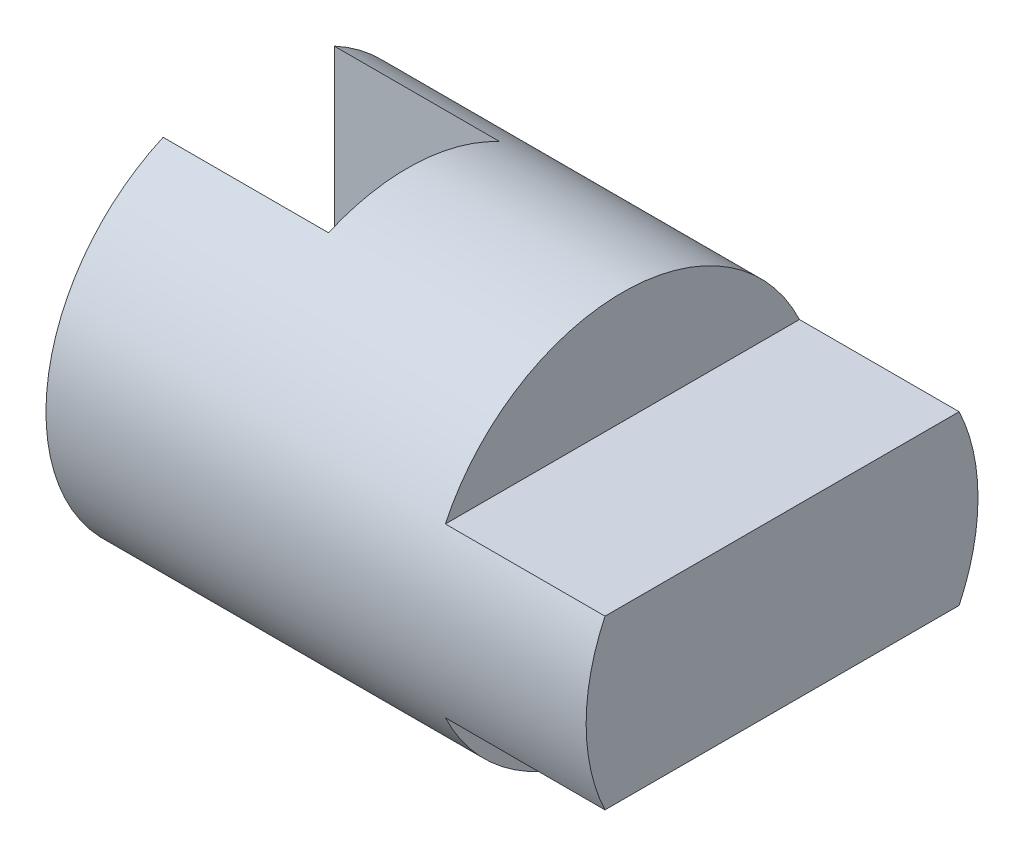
ISO-10303-21;
HEADER;
FILE_DESCRIPTION(('STEP AP214'),'2;1');
FILE_NAME('part.step','',(''),(''),'','','');
FILE_SCHEMA(('AUTOMOTIVE_DESIGN { 1 0 10303 214 1 1 1 1 }'));
ENDSEC;
DATA;
#1=APPLICATION_CONTEXT('core data for automotive mechanical design processes');
#2=APPLICATION_PROTOCOL_DEFINITION('international standard','automotive_design',2000,#1);
#3=PRODUCT_CONTEXT('',#1,'mechanical');
#4=PRODUCT('Part','Part','',(#3));
#5=PRODUCT_RELATED_PRODUCT_CATEGORY('part','',(#4));
#6=PRODUCT_DEFINITION_FORMATION('','',#4);
#7=PRODUCT_DEFINITION_CONTEXT('part definition',#1,'design');
#8=PRODUCT_DEFINITION('design','',#6,#7);
#9=PRODUCT_DEFINITION_SHAPE('','',#8);
#10=(LENGTH_UNIT() NAMED_UNIT(*) SI_UNIT(.MILLI.,.METRE.));
#11=(NAMED_UNIT(*) PLANE_ANGLE_UNIT() SI_UNIT($,.RADIAN.));
#12=(NAMED_UNIT(*) SI_UNIT($,.STERADIAN.) SOLID_ANGLE_UNIT());
#13=UNCERTAINTY_MEASURE_WITH_UNIT(LENGTH_MEASURE(1.E-05),#10,'distance_accuracy_value','');
#14=(GEOMETRIC_REPRESENTATION_CONTEXT(3) GLOBAL_UNCERTAINTY_ASSIGNED_CONTEXT((#13)) GLOBAL_UNIT_ASSIGNED_CONTEXT((#10,
#11,#12)) REPRESENTATION_CONTEXT('',''));
#15=CARTESIAN_POINT('',(0.,0.,0.));
#16=DIRECTION('',(0.,0.,1.));
#17=DIRECTION('',(1.,0.,0.));
#18=AXIS2_PLACEMENT_3D('',#15,#16,#17);
#19=CARTESIAN_POINT('',(-55.4943825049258,0.,0.));
#20=DIRECTION('',(1.,0.,0.));
#21=DIRECTION('',(0.,0.,-1.));
#22=AXIS2_PLACEMENT_3D('',#19,#20,#21);
#23=PLANE('',#22);
#24=CARTESIAN_POINT('',(-55.4943825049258,0.,0.));
#25=DIRECTION('',(-1.,0.,0.));
#26=DIRECTION('',(0.,0.,1.));
#27=AXIS2_PLACEMENT_3D('',#24,#25,#26);
#28=CIRCLE('',#27,37.2702200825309);
#29=CARTESIAN_POINT('',(-55.4943825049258,32.8639869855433,-17.5791827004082));
#30=VERTEX_POINT('',#29);
#31=CARTESIAN_POINT('',(-55.4943825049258,-32.8639869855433,-17.5791827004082));
#32=VERTEX_POINT('',#31);
#33=EDGE_CURVE('E151',#30,#32,#28,.T.);
#34=ORIENTED_EDGE('',*,*,#33,.T.);
#35=DIRECTION('',(0.,1.,0.));
#36=VECTOR('',#35,1.);
#37=CARTESIAN_POINT('',(-55.4943825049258,-37.2702200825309,-17.5791827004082));
#38=LINE('',#37,#36);
#39=EDGE_CURVE('E133',#32,#30,#38,.T.);
#40=ORIENTED_EDGE('',*,*,#39,.T.);
#41=EDGE_LOOP('',(#34,#40));
#42=FACE_BOUND('',#41,.T.);
#43=ADVANCED_FACE('F31',(#42),#23,.F.);
#44=CARTESIAN_POINT('',(-55.4943825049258,-34.125283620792,14.9844693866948));
#45=VERTEX_POINT('',#44);
#46=CARTESIAN_POINT('',(-55.4943825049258,34.125283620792,14.9844693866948));
#47=VERTEX_POINT('',#46);
#48=EDGE_CURVE('E124',#45,#47,#28,.T.);
#49=ORIENTED_EDGE('',*,*,#48,.T.);
#50=DIRECTION('',(0.,1.,0.));
#51=VECTOR('',#50,1.);
#52=CARTESIAN_POINT('',(-55.4943825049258,-37.2702200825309,14.9844693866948));
#53=LINE('',#52,#51);
#54=EDGE_CURVE('E103',#45,#47,#53,.T.);
#55=ORIENTED_EDGE('',*,*,#54,.F.);
#56=EDGE_LOOP('',(#49,#55));
#57=FACE_BOUND('',#56,.T.);
#58=ADVANCED_FACE('F33',(#57),#23,.F.);
#59=CARTESIAN_POINT('',(-80.4401871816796,0.,0.));
#60=DIRECTION('',(-1.,0.,0.));
#61=DIRECTION('',(0.,0.,1.));
#62=AXIS2_PLACEMENT_3D('',#59,#60,#61);
#63=CYLINDRICAL_SURFACE('',#62,37.2702200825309);
#64=CARTESIAN_POINT('',(16.8863951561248,0.,0.));
#65=DIRECTION('',(-1.,0.,0.));
#66=DIRECTION('',(0.,-1.,0.));
#67=AXIS2_PLACEMENT_3D('',#64,#65,#66);
#68=CIRCLE('',#67,37.2702200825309);
#69=CARTESIAN_POINT('',(16.8863951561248,-15.9589152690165,-33.6805927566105));
#70=VERTEX_POINT('',#69);
#71=CARTESIAN_POINT('',(16.8863951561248,-15.9589152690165,33.6805927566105));
#72=VERTEX_POINT('',#71);
#73=EDGE_CURVE('E116',#70,#72,#68,.T.);
#74=ORIENTED_EDGE('',*,*,#73,.T.);
#75=DIRECTION('',(-1.,0.,0.));
#76=VECTOR('',#75,1.);
#77=CARTESIAN_POINT('',(-80.4401871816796,-15.9589152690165,33.6805927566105));
#78=LINE('',#77,#76);
#79=CARTESIAN_POINT('',(47.2585748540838,-15.9589152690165,33.6805927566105));
#80=VERTEX_POINT('',#79);
#81=EDGE_CURVE('E132',#72,#80,#78,.F.);
#82=ORIENTED_EDGE('',*,*,#81,.T.);
#83=CARTESIAN_POINT('',(47.2585748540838,0.,0.));
#84=DIRECTION('',(-1.,0.,0.));
#85=DIRECTION('',(0.,0.,1.));
#86=AXIS2_PLACEMENT_3D('',#83,#84,#85);
#87=CIRCLE('',#86,37.2702200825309);
#88=CARTESIAN_POINT('',(47.2585748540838,15.9589152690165,33.6805927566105));
#89=VERTEX_POINT('',#88);
#90=EDGE_CURVE('E146',#80,#89,#87,.T.);
#91=ORIENTED_EDGE('',*,*,#90,.T.);
#92=DIRECTION('',(-1.,0.,0.));
#93=VECTOR('',#92,1.);
#94=CARTESIAN_POINT('',(-80.4401871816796,15.9589152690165,33.6805927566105));
#95=LINE('',#94,#93);
#96=CARTESIAN_POINT('',(16.8863951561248,15.9589152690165,33.6805927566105));
#97=VERTEX_POINT('',#96);
#98=EDGE_CURVE('E143',#89,#97,#95,.T.);
#99=ORIENTED_EDGE('',*,*,#98,.T.);
#100=CARTESIAN_POINT('',(16.8863951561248,0.,0.));
#101=DIRECTION('',(-1.,0.,0.));
#102=DIRECTION('',(0.,0.,1.));
#103=AXIS2_PLACEMENT_3D('',#100,#101,#102);
#104=CIRCLE('',#103,37.2702200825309);
#105=CARTESIAN_POINT('',(16.8863951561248,15.9589152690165,-33.6805927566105));
#106=VERTEX_POINT('',#105);
#107=EDGE_CURVE('E155',#97,#106,#104,.T.);
#108=ORIENTED_EDGE('',*,*,#107,.T.);
#109=DIRECTION('',(-1.,0.,0.));
#110=VECTOR('',#109,1.);
#111=CARTESIAN_POINT('',(-80.4401871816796,15.9589152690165,-33.6805927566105));
#112=LINE('',#111,#110);
#113=CARTESIAN_POINT('',(47.2585748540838,15.9589152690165,-33.6805927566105));
#114=VERTEX_POINT('',#113);
#115=EDGE_CURVE('E140',#106,#114,#112,.F.);
#116=ORIENTED_EDGE('',*,*,#115,.T.);
#117=CARTESIAN_POINT('',(47.2585748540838,-15.9589152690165,-33.6805927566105));
#118=VERTEX_POINT('',#117);
#119=EDGE_CURVE('E147',#114,#118,#87,.T.);
#120=ORIENTED_EDGE('',*,*,#119,.T.);
#121=DIRECTION('',(-1.,0.,0.));
#122=VECTOR('',#121,1.);
#123=CARTESIAN_POINT('',(-80.4401871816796,-15.9589152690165,-33.6805927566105));
#124=LINE('',#123,#122);
#125=EDGE_CURVE('E54',#118,#70,#124,.T.);
#126=ORIENTED_EDGE('',*,*,#125,.T.);
#127=EDGE_LOOP('',(#74,#82,#91,#99,#108,#116,#120,#126));
#128=FACE_BOUND('',#127,.T.);
#129=ORIENTED_EDGE('',*,*,#33,.F.);
#130=DIRECTION('',(-1.,0.,0.));
#131=VECTOR('',#130,1.);
#132=CARTESIAN_POINT('',(-80.4401871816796,32.8639869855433,-17.5791827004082));
#133=LINE('',#132,#131);
#134=CARTESIAN_POINT('',(-24.0323285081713,32.8639869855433,-17.5791827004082));
#135=VERTEX_POINT('',#134);
#136=EDGE_CURVE('E11',#30,#135,#133,.F.);
#137=ORIENTED_EDGE('',*,*,#136,.T.);
#138=CARTESIAN_POINT('',(-24.0323285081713,0.,0.));
#139=DIRECTION('',(1.,0.,0.));
#140=DIRECTION('',(0.,0.,-1.));
#141=AXIS2_PLACEMENT_3D('',#138,#139,#140);
#142=CIRCLE('',#141,37.2702200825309);
#143=CARTESIAN_POINT('',(-24.0323285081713,34.125283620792,14.9844693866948));
#144=VERTEX_POINT('',#143);
#145=EDGE_CURVE('E108',#135,#144,#142,.T.);
#146=ORIENTED_EDGE('',*,*,#145,.T.);
#147=DIRECTION('',(-1.,0.,0.));
#148=VECTOR('',#147,1.);
#149=CARTESIAN_POINT('',(-80.4401871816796,34.125283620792,14.9844693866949));
#150=LINE('',#149,#148);
#151=EDGE_CURVE('E98',#144,#47,#150,.T.);
#152=ORIENTED_EDGE('',*,*,#151,.T.);
#153=ORIENTED_EDGE('',*,*,#48,.F.);
#154=DIRECTION('',(-1.,0.,0.));
#155=VECTOR('',#154,1.);
#156=CARTESIAN_POINT('',(-80.4401871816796,-34.125283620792,14.9844693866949));
#157=LINE('',#156,#155);
#158=CARTESIAN_POINT('',(-24.0323285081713,-34.125283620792,14.9844693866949));
#159=VERTEX_POINT('',#158);
#160=EDGE_CURVE('E39',#45,#159,#157,.F.);
#161=ORIENTED_EDGE('',*,*,#160,.T.);
#162=CARTESIAN_POINT('',(-24.0323285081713,-32.8639869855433,-17.5791827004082));
#163=VERTEX_POINT('',#162);
#164=EDGE_CURVE('E46',#159,#163,#142,.T.);
#165=ORIENTED_EDGE('',*,*,#164,.T.);
#166=DIRECTION('',(-1.,0.,0.));
#167=VECTOR('',#166,1.);
#168=CARTESIAN_POINT('',(-80.4401871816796,-32.8639869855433,-17.5791827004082));
#169=LINE('',#168,#167);
#170=EDGE_CURVE('E120',#163,#32,#169,.T.);
#171=ORIENTED_EDGE('',*,*,#170,.T.);
#172=EDGE_LOOP('',(#129,#137,#146,#152,#153,#161,#165,#171));
#173=FACE_BOUND('',#172,.T.);
#174=ADVANCED_FACE('F115',(#128,#173),#63,.T.);
#175=CARTESIAN_POINT('',(47.2585748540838,37.2702200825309,0.));
#176=DIRECTION('',(-1.,0.,0.));
#177=DIRECTION('',(0.,0.,1.));
#178=AXIS2_PLACEMENT_3D('',#175,#176,#177);
#179=PLANE('',#178);
#180=ORIENTED_EDGE('',*,*,#90,.F.);
#181=DIRECTION('',(0.,0.,-1.));
#182=VECTOR('',#181,1.);
#183=CARTESIAN_POINT('',(47.2585748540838,-15.9589152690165,0.));
#184=LINE('',#183,#182);
#185=EDGE_CURVE('E118',#80,#118,#184,.T.);
#186=ORIENTED_EDGE('',*,*,#185,.T.);
#187=ORIENTED_EDGE('',*,*,#119,.F.);
#188=DIRECTION('',(0.,0.,1.));
#189=VECTOR('',#188,1.);
#190=CARTESIAN_POINT('',(47.2585748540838,15.9589152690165,0.));
#191=LINE('',#190,#189);
#192=EDGE_CURVE('E152',#114,#89,#191,.T.);
#193=ORIENTED_EDGE('',*,*,#192,.T.);
#194=EDGE_LOOP('',(#180,#186,#187,#193));
#195=FACE_BOUND('',#194,.T.);
#196=ADVANCED_FACE('F161',(#195),#179,.F.);
#197=CARTESIAN_POINT('',(16.8863951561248,37.2702200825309,-37.2702200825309));
#198=DIRECTION('',(-1.,0.,0.));
#199=DIRECTION('',(0.,0.,1.));
#200=AXIS2_PLACEMENT_3D('',#197,#198,#199);
#201=PLANE('',#200);
#202=DIRECTION('',(0.,0.,1.));
#203=VECTOR('',#202,1.);
#204=CARTESIAN_POINT('',(16.8863951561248,15.9589152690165,-37.2702200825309));
#205=LINE('',#204,#203);
#206=EDGE_CURVE('E137',#106,#97,#205,.T.);
#207=ORIENTED_EDGE('',*,*,#206,.F.);
#208=ORIENTED_EDGE('',*,*,#107,.F.);
#209=EDGE_LOOP('',(#207,#208));
#210=FACE_BOUND('',#209,.T.);
#211=ADVANCED_FACE('F169',(#210),#201,.F.);
#212=CARTESIAN_POINT('',(16.8863951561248,15.9589152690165,-37.2702200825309));
#213=DIRECTION('',(0.,-1.,0.));
#214=DIRECTION('',(0.,0.,-1.));
#215=AXIS2_PLACEMENT_3D('',#212,#213,#214);
#216=PLANE('',#215);
#217=ORIENTED_EDGE('',*,*,#192,.F.);
#218=ORIENTED_EDGE('',*,*,#115,.F.);
#219=ORIENTED_EDGE('',*,*,#206,.T.);
#220=ORIENTED_EDGE('',*,*,#98,.F.);
#221=EDGE_LOOP('',(#217,#218,#219,#220));
#222=FACE_BOUND('',#221,.T.);
#223=ADVANCED_FACE('F166',(#222),#216,.F.);
#224=CARTESIAN_POINT('',(16.8863951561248,-37.2702200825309,-37.2702200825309));
#225=DIRECTION('',(-1.,0.,0.));
#226=DIRECTION('',(0.,-1.,0.));
#227=AXIS2_PLACEMENT_3D('',#224,#225,#226);
#228=PLANE('',#227);
#229=ORIENTED_EDGE('',*,*,#73,.F.);
#230=DIRECTION('',(0.,0.,1.));
#231=VECTOR('',#230,1.);
#232=CARTESIAN_POINT('',(16.8863951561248,-15.9589152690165,-37.2702200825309));
#233=LINE('',#232,#231);
#234=EDGE_CURVE('E129',#70,#72,#233,.T.);
#235=ORIENTED_EDGE('',*,*,#234,.T.);
#236=EDGE_LOOP('',(#229,#235));
#237=FACE_BOUND('',#236,.T.);
#238=ADVANCED_FACE('F176',(#237),#228,.F.);
#239=CARTESIAN_POINT('',(16.8863951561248,-15.9589152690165,-37.2702200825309));
#240=DIRECTION('',(0.,1.,0.));
#241=DIRECTION('',(0.,0.,1.));
#242=AXIS2_PLACEMENT_3D('',#239,#240,#241);
#243=PLANE('',#242);
#244=ORIENTED_EDGE('',*,*,#185,.F.);
#245=ORIENTED_EDGE('',*,*,#81,.F.);
#246=ORIENTED_EDGE('',*,*,#234,.F.);
#247=ORIENTED_EDGE('',*,*,#125,.F.);
#248=EDGE_LOOP('',(#244,#245,#246,#247));
#249=FACE_BOUND('',#248,.T.);
#250=ADVANCED_FACE('F189',(#249),#243,.F.);
#251=CARTESIAN_POINT('',(-55.4943825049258,-37.2702200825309,-17.5791827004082));
#252=DIRECTION('',(0.,0.,-1.));
#253=DIRECTION('',(-1.,0.,0.));
#254=AXIS2_PLACEMENT_3D('',#251,#252,#253);
#255=PLANE('',#254);
#256=DIRECTION('',(0.,1.,0.));
#257=VECTOR('',#256,1.);
#258=CARTESIAN_POINT('',(-24.0323285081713,-37.2702200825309,-17.5791827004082));
#259=LINE('',#258,#257);
#260=EDGE_CURVE('E112',#163,#135,#259,.T.);
#261=ORIENTED_EDGE('',*,*,#260,.T.);
#262=ORIENTED_EDGE('',*,*,#136,.F.);
#263=ORIENTED_EDGE('',*,*,#39,.F.);
#264=ORIENTED_EDGE('',*,*,#170,.F.);
#265=EDGE_LOOP('',(#261,#262,#263,#264));
#266=FACE_BOUND('',#265,.T.);
#267=ADVANCED_FACE('F187',(#266),#255,.F.);
#268=CARTESIAN_POINT('',(-24.0323285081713,-37.2702200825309,-17.5791827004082));
#269=DIRECTION('',(1.,0.,0.));
#270=DIRECTION('',(0.,0.,-1.));
#271=AXIS2_PLACEMENT_3D('',#268,#269,#270);
#272=PLANE('',#271);
#273=ORIENTED_EDGE('',*,*,#260,.F.);
#274=ORIENTED_EDGE('',*,*,#164,.F.);
#275=DIRECTION('',(0.,1.,0.));
#276=VECTOR('',#275,1.);
#277=CARTESIAN_POINT('',(-24.0323285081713,-37.2702200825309,14.9844693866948));
#278=LINE('',#277,#276);
#279=EDGE_CURVE('E100',#159,#144,#278,.T.);
#280=ORIENTED_EDGE('',*,*,#279,.T.);
#281=ORIENTED_EDGE('',*,*,#145,.F.);
#282=EDGE_LOOP('',(#273,#274,#280,#281));
#283=FACE_BOUND('',#282,.T.);
#284=ADVANCED_FACE('F110',(#283),#272,.F.);
#285=CARTESIAN_POINT('',(-24.0323285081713,-37.2702200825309,14.9844693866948));
#286=DIRECTION('',(0.,0.,1.));
#287=DIRECTION('',(1.,0.,0.));
#288=AXIS2_PLACEMENT_3D('',#285,#286,#287);
#289=PLANE('',#288);
#290=ORIENTED_EDGE('',*,*,#279,.F.);
#291=ORIENTED_EDGE('',*,*,#160,.F.);
#292=ORIENTED_EDGE('',*,*,#54,.T.);
#293=ORIENTED_EDGE('',*,*,#151,.F.);
#294=EDGE_LOOP('',(#290,#291,#292,#293));
#295=FACE_BOUND('',#294,.T.);
#296=ADVANCED_FACE('F99',(#295),#289,.F.);
#297=CLOSED_SHELL('',(#43,#58,#174,#196,#211,#223,#238,#250,#267,#284,#296));
#298=MANIFOLD_SOLID_BREP('B2',#297);
#299=ADVANCED_BREP_SHAPE_REPRESENTATION('',(#18,#298),#14);
#300=SHAPE_DEFINITION_REPRESENTATION(#9,#299);
ENDSEC;
END-ISO-10303-21;
